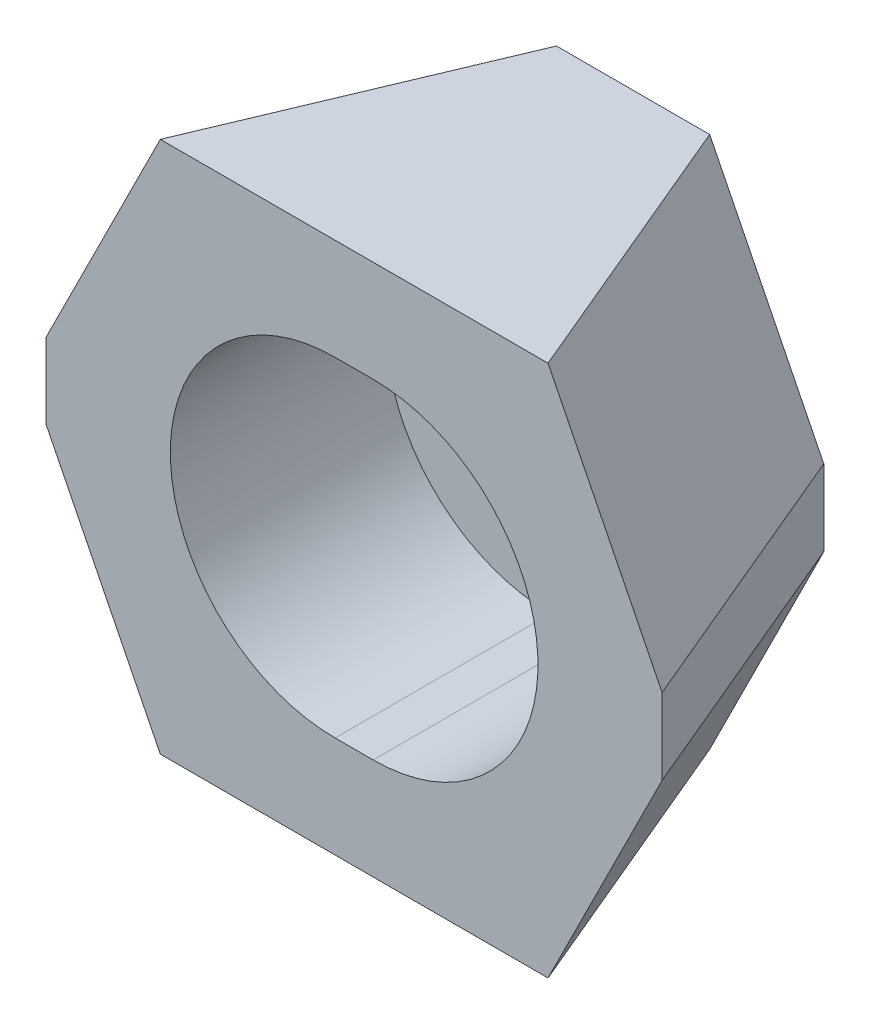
ISO-10303-21;
HEADER;
FILE_DESCRIPTION(('STEP AP214'),'2;1');
FILE_NAME('part.step','',(''),(''),'','','');
FILE_SCHEMA(('AUTOMOTIVE_DESIGN { 1 0 10303 214 1 1 1 1 }'));
ENDSEC;
DATA;
#1=APPLICATION_CONTEXT('core data for automotive mechanical design processes');
#2=APPLICATION_PROTOCOL_DEFINITION('international standard','automotive_design',2000,#1);
#3=PRODUCT_CONTEXT('',#1,'mechanical');
#4=PRODUCT('Part','Part','',(#3));
#5=PRODUCT_RELATED_PRODUCT_CATEGORY('part','',(#4));
#6=PRODUCT_DEFINITION_FORMATION('','',#4);
#7=PRODUCT_DEFINITION_CONTEXT('part definition',#1,'design');
#8=PRODUCT_DEFINITION('design','',#6,#7);
#9=PRODUCT_DEFINITION_SHAPE('','',#8);
#10=(LENGTH_UNIT() NAMED_UNIT(*) SI_UNIT(.MILLI.,.METRE.));
#11=(NAMED_UNIT(*) PLANE_ANGLE_UNIT() SI_UNIT($,.RADIAN.));
#12=(NAMED_UNIT(*) SI_UNIT($,.STERADIAN.) SOLID_ANGLE_UNIT());
#13=UNCERTAINTY_MEASURE_WITH_UNIT(LENGTH_MEASURE(1.E-05),#10,'distance_accuracy_value','');
#14=(GEOMETRIC_REPRESENTATION_CONTEXT(3) GLOBAL_UNCERTAINTY_ASSIGNED_CONTEXT((#13)) GLOBAL_UNIT_ASSIGNED_CONTEXT((#10,
#11,#12)) REPRESENTATION_CONTEXT('',''));
#15=CARTESIAN_POINT('',(0.,0.,0.));
#16=DIRECTION('',(0.,0.,1.));
#17=DIRECTION('',(1.,0.,0.));
#18=AXIS2_PLACEMENT_3D('',#15,#16,#17);
#19=CARTESIAN_POINT('',(-1.5,0.,5.));
#20=DIRECTION('',(0.,0.,1.));
#21=DIRECTION('',(1.,0.,0.));
#22=AXIS2_PLACEMENT_3D('',#19,#20,#21);
#23=CYLINDRICAL_SURFACE('',#22,13.);
#24=DIRECTION('',(0.,0.,1.));
#25=VECTOR('',#24,1.);
#26=CARTESIAN_POINT('',(-1.5,13.,5.));
#27=LINE('',#26,#25);
#28=CARTESIAN_POINT('',(-1.5,13.,5.));
#29=VERTEX_POINT('',#28);
#30=CARTESIAN_POINT('',(-1.5,13.,22.));
#31=VERTEX_POINT('',#30);
#32=EDGE_CURVE('E245',#29,#31,#27,.T.);
#33=ORIENTED_EDGE('',*,*,#32,.T.);
#34=CARTESIAN_POINT('',(-1.5,0.,22.));
#35=DIRECTION('',(0.,0.,1.));
#36=DIRECTION('',(1.,0.,0.));
#37=AXIS2_PLACEMENT_3D('',#34,#35,#36);
#38=CIRCLE('',#37,13.);
#39=CARTESIAN_POINT('',(-1.5,-13.,22.));
#40=VERTEX_POINT('',#39);
#41=EDGE_CURVE('E230',#31,#40,#38,.T.);
#42=ORIENTED_EDGE('',*,*,#41,.T.);
#43=DIRECTION('',(0.,0.,1.));
#44=VECTOR('',#43,1.);
#45=CARTESIAN_POINT('',(-1.5,-13.,5.));
#46=LINE('',#45,#44);
#47=CARTESIAN_POINT('',(-1.5,-13.,5.));
#48=VERTEX_POINT('',#47);
#49=EDGE_CURVE('E239',#48,#40,#46,.T.);
#50=ORIENTED_EDGE('',*,*,#49,.F.);
#51=CARTESIAN_POINT('',(-1.5,0.,5.));
#52=DIRECTION('',(0.,0.,1.));
#53=DIRECTION('',(1.,0.,0.));
#54=AXIS2_PLACEMENT_3D('',#51,#52,#53);
#55=CIRCLE('',#54,13.);
#56=EDGE_CURVE('E236',#29,#48,#55,.T.);
#57=ORIENTED_EDGE('',*,*,#56,.F.);
#58=EDGE_LOOP('',(#33,#42,#50,#57));
#59=FACE_BOUND('',#58,.T.);
#60=ADVANCED_FACE('F14',(#59),#23,.F.);
#61=CARTESIAN_POINT('',(-1.5,13.,5.));
#62=DIRECTION('',(0.,-1.,0.));
#63=DIRECTION('',(0.,0.,-1.));
#64=AXIS2_PLACEMENT_3D('',#61,#62,#63);
#65=PLANE('',#64);
#66=DIRECTION('',(1.,0.,0.));
#67=VECTOR('',#66,1.);
#68=CARTESIAN_POINT('',(-1.5,13.,5.));
#69=LINE('',#68,#67);
#70=CARTESIAN_POINT('',(1.5,13.,5.));
#71=VERTEX_POINT('',#70);
#72=EDGE_CURVE('E232',#29,#71,#69,.T.);
#73=ORIENTED_EDGE('',*,*,#72,.T.);
#74=DIRECTION('',(0.,0.,1.));
#75=VECTOR('',#74,1.);
#76=CARTESIAN_POINT('',(1.5,13.,5.));
#77=LINE('',#76,#75);
#78=CARTESIAN_POINT('',(1.5,13.,22.));
#79=VERTEX_POINT('',#78);
#80=EDGE_CURVE('E185',#71,#79,#77,.T.);
#81=ORIENTED_EDGE('',*,*,#80,.T.);
#82=DIRECTION('',(1.,0.,0.));
#83=VECTOR('',#82,1.);
#84=CARTESIAN_POINT('',(-1.5,13.,22.));
#85=LINE('',#84,#83);
#86=EDGE_CURVE('E229',#31,#79,#85,.T.);
#87=ORIENTED_EDGE('',*,*,#86,.F.);
#88=ORIENTED_EDGE('',*,*,#32,.F.);
#89=EDGE_LOOP('',(#73,#81,#87,#88));
#90=FACE_BOUND('',#89,.T.);
#91=ADVANCED_FACE('F418',(#90),#65,.T.);
#92=CARTESIAN_POINT('',(-1.5,-13.,5.));
#93=DIRECTION('',(0.,-1.,0.));
#94=DIRECTION('',(0.,0.,-1.));
#95=AXIS2_PLACEMENT_3D('',#92,#93,#94);
#96=PLANE('',#95);
#97=DIRECTION('',(1.,0.,0.));
#98=VECTOR('',#97,1.);
#99=CARTESIAN_POINT('',(-1.5,-13.,22.));
#100=LINE('',#99,#98);
#101=CARTESIAN_POINT('',(1.5,-13.,22.));
#102=VERTEX_POINT('',#101);
#103=EDGE_CURVE('E233',#40,#102,#100,.T.);
#104=ORIENTED_EDGE('',*,*,#103,.T.);
#105=DIRECTION('',(0.,0.,1.));
#106=VECTOR('',#105,1.);
#107=CARTESIAN_POINT('',(1.5,-13.,5.));
#108=LINE('',#107,#106);
#109=CARTESIAN_POINT('',(1.5,-13.,5.));
#110=VERTEX_POINT('',#109);
#111=EDGE_CURVE('E362',#110,#102,#108,.T.);
#112=ORIENTED_EDGE('',*,*,#111,.F.);
#113=DIRECTION('',(1.,0.,0.));
#114=VECTOR('',#113,1.);
#115=CARTESIAN_POINT('',(-1.5,-13.,5.));
#116=LINE('',#115,#114);
#117=EDGE_CURVE('E240',#48,#110,#116,.T.);
#118=ORIENTED_EDGE('',*,*,#117,.F.);
#119=ORIENTED_EDGE('',*,*,#49,.T.);
#120=EDGE_LOOP('',(#104,#112,#118,#119));
#121=FACE_BOUND('',#120,.T.);
#122=ADVANCED_FACE('F425',(#121),#96,.F.);
#123=CARTESIAN_POINT('',(-1.5,0.,5.));
#124=DIRECTION('',(0.,0.,1.));
#125=DIRECTION('',(1.,0.,0.));
#126=AXIS2_PLACEMENT_3D('',#123,#124,#125);
#127=PLANE('',#126);
#128=DIRECTION('',(-1.,0.,0.));
#129=VECTOR('',#128,1.);
#130=CARTESIAN_POINT('',(-1.5,8.5,5.));
#131=LINE('',#130,#129);
#132=CARTESIAN_POINT('',(1.5,8.5,5.));
#133=VERTEX_POINT('',#132);
#134=CARTESIAN_POINT('',(-1.5,8.5,5.));
#135=VERTEX_POINT('',#134);
#136=EDGE_CURVE('E222',#133,#135,#131,.T.);
#137=ORIENTED_EDGE('',*,*,#136,.F.);
#138=CARTESIAN_POINT('',(1.5,0.,5.));
#139=DIRECTION('',(0.,0.,-1.));
#140=DIRECTION('',(-1.,0.,0.));
#141=AXIS2_PLACEMENT_3D('',#138,#139,#140);
#142=CIRCLE('',#141,8.5);
#143=CARTESIAN_POINT('',(1.5,-8.5,5.));
#144=VERTEX_POINT('',#143);
#145=EDGE_CURVE('E371',#133,#144,#142,.T.);
#146=ORIENTED_EDGE('',*,*,#145,.T.);
#147=DIRECTION('',(-1.,0.,0.));
#148=VECTOR('',#147,1.);
#149=CARTESIAN_POINT('',(-1.5,-8.5,5.));
#150=LINE('',#149,#148);
#151=CARTESIAN_POINT('',(-1.5,-8.5,5.));
#152=VERTEX_POINT('',#151);
#153=EDGE_CURVE('E224',#144,#152,#150,.T.);
#154=ORIENTED_EDGE('',*,*,#153,.T.);
#155=CARTESIAN_POINT('',(-1.5,0.,5.));
#156=DIRECTION('',(0.,0.,1.));
#157=DIRECTION('',(1.,0.,0.));
#158=AXIS2_PLACEMENT_3D('',#155,#156,#157);
#159=CIRCLE('',#158,8.5);
#160=EDGE_CURVE('E226',#135,#152,#159,.T.);
#161=ORIENTED_EDGE('',*,*,#160,.F.);
#162=EDGE_LOOP('',(#137,#146,#154,#161));
#163=FACE_BOUND('',#162,.T.);
#164=CARTESIAN_POINT('',(1.5,0.,5.));
#165=DIRECTION('',(0.,0.,-1.));
#166=DIRECTION('',(-1.,0.,0.));
#167=AXIS2_PLACEMENT_3D('',#164,#165,#166);
#168=CIRCLE('',#167,13.);
#169=EDGE_CURVE('E365',#71,#110,#168,.T.);
#170=ORIENTED_EDGE('',*,*,#169,.F.);
#171=ORIENTED_EDGE('',*,*,#72,.F.);
#172=ORIENTED_EDGE('',*,*,#56,.T.);
#173=ORIENTED_EDGE('',*,*,#117,.T.);
#174=EDGE_LOOP('',(#170,#171,#172,#173));
#175=FACE_BOUND('',#174,.T.);
#176=ADVANCED_FACE('F428',(#163,#175),#127,.T.);
#177=CARTESIAN_POINT('',(-6.,21.,0.));
#178=DIRECTION('',(0.,1.,0.));
#179=DIRECTION('',(0.,0.,1.));
#180=AXIS2_PLACEMENT_3D('',#177,#178,#179);
#181=PLANE('',#180);
#182=DIRECTION('',(1.,0.,0.));
#183=VECTOR('',#182,1.);
#184=CARTESIAN_POINT('',(-15.,21.,22.));
#185=LINE('',#184,#183);
#186=CARTESIAN_POINT('',(-15.,21.,22.));
#187=VERTEX_POINT('',#186);
#188=CARTESIAN_POINT('',(15.,21.,22.));
#189=VERTEX_POINT('',#188);
#190=EDGE_CURVE('E297',#187,#189,#185,.T.);
#191=ORIENTED_EDGE('',*,*,#190,.T.);
#192=DIRECTION('',(1.,0.,0.));
#193=VECTOR('',#192,1.);
#194=CARTESIAN_POINT('',(15.,21.,22.));
#195=LINE('',#194,#193);
#196=CARTESIAN_POINT('',(15.2922839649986,21.,22.));
#197=VERTEX_POINT('',#196);
#198=EDGE_CURVE('E347',#189,#197,#195,.T.);
#199=ORIENTED_EDGE('',*,*,#198,.T.);
#200=DIRECTION('',(-0.387515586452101,0.,-0.921863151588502));
#201=VECTOR('',#200,1.);
#202=CARTESIAN_POINT('',(6.0376777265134,21.,-0.0158382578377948));
#203=LINE('',#202,#201);
#204=CARTESIAN_POINT('',(6.04433551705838,21.,0.));
#205=VERTEX_POINT('',#204);
#206=EDGE_CURVE('E381',#197,#205,#203,.T.);
#207=ORIENTED_EDGE('',*,*,#206,.T.);
#208=CARTESIAN_POINT('',(6.04433551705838,21.,0.));
#209=DIRECTION('',(-1.,0.,0.));
#210=VECTOR('',#209,1.);
#211=LINE('',#208,#210);
#212=CARTESIAN_POINT('',(6.,21.,0.));
#213=VERTEX_POINT('',#212);
#214=EDGE_CURVE('E258',#205,#213,#211,.T.);
#215=ORIENTED_EDGE('',*,*,#214,.T.);
#216=DIRECTION('',(1.,0.,0.));
#217=VECTOR('',#216,1.);
#218=CARTESIAN_POINT('',(-6.,21.,0.));
#219=LINE('',#218,#217);
#220=CARTESIAN_POINT('',(-6.,21.,0.));
#221=VERTEX_POINT('',#220);
#222=EDGE_CURVE('E299',#221,#213,#219,.T.);
#223=ORIENTED_EDGE('',*,*,#222,.F.);
#224=CARTESIAN_POINT('',(-6.04433551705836,21.,0.));
#225=DIRECTION('',(1.,0.,0.));
#226=VECTOR('',#225,1.);
#227=LINE('',#224,#226);
#228=CARTESIAN_POINT('',(-6.04433551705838,21.,0.));
#229=VERTEX_POINT('',#228);
#230=EDGE_CURVE('E211',#229,#221,#227,.T.);
#231=ORIENTED_EDGE('',*,*,#230,.F.);
#232=DIRECTION('',(0.387515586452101,0.,-0.921863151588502));
#233=VECTOR('',#232,1.);
#234=CARTESIAN_POINT('',(-6.0376777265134,21.,-0.0158382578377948));
#235=LINE('',#234,#233);
#236=CARTESIAN_POINT('',(-15.2922839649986,21.,22.));
#237=VERTEX_POINT('',#236);
#238=EDGE_CURVE('E205',#237,#229,#235,.T.);
#239=ORIENTED_EDGE('',*,*,#238,.F.);
#240=DIRECTION('',(-1.,0.,0.));
#241=VECTOR('',#240,1.);
#242=CARTESIAN_POINT('',(-15.,21.,22.));
#243=LINE('',#242,#241);
#244=EDGE_CURVE('E327',#187,#237,#243,.T.);
#245=ORIENTED_EDGE('',*,*,#244,.F.);
#246=EDGE_LOOP('',(#191,#199,#207,#215,#223,#231,#239,#245));
#247=FACE_BOUND('',#246,.T.);
#248=ADVANCED_FACE('F272',(#247),#181,.T.);
#249=CARTESIAN_POINT('',(-24.2922839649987,3.,22.));
#250=DIRECTION('',(0.,0.,1.));
#251=DIRECTION('',(1.,0.,0.));
#252=AXIS2_PLACEMENT_3D('',#249,#250,#251);
#253=PLANE('',#252);
#254=ORIENTED_EDGE('',*,*,#86,.T.);
#255=CARTESIAN_POINT('',(1.5,0.,22.));
#256=DIRECTION('',(0.,0.,-1.));
#257=DIRECTION('',(-1.,0.,0.));
#258=AXIS2_PLACEMENT_3D('',#255,#256,#257);
#259=CIRCLE('',#258,13.);
#260=EDGE_CURVE('E368',#79,#102,#259,.T.);
#261=ORIENTED_EDGE('',*,*,#260,.T.);
#262=ORIENTED_EDGE('',*,*,#103,.F.);
#263=ORIENTED_EDGE('',*,*,#41,.F.);
#264=EDGE_LOOP('',(#254,#261,#262,#263));
#265=FACE_BOUND('',#264,.T.);
#266=ORIENTED_EDGE('',*,*,#198,.F.);
#267=ORIENTED_EDGE('',*,*,#190,.F.);
#268=ORIENTED_EDGE('',*,*,#244,.T.);
#269=DIRECTION('',(0.447213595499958,0.894427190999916,0.));
#270=VECTOR('',#269,1.);
#271=CARTESIAN_POINT('',(-24.2922839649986,2.99999999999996,22.));
#272=LINE('',#271,#270);
#273=CARTESIAN_POINT('',(-24.2922839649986,3.,22.));
#274=VERTEX_POINT('',#273);
#275=EDGE_CURVE('E207',#274,#237,#272,.T.);
#276=ORIENTED_EDGE('',*,*,#275,.F.);
#277=DIRECTION('',(0.,-1.,0.));
#278=VECTOR('',#277,1.);
#279=CARTESIAN_POINT('',(-24.2922839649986,3.,22.));
#280=LINE('',#279,#278);
#281=CARTESIAN_POINT('',(-24.2922839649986,-3.,22.));
#282=VERTEX_POINT('',#281);
#283=EDGE_CURVE('E202',#274,#282,#280,.T.);
#284=ORIENTED_EDGE('',*,*,#283,.T.);
#285=DIRECTION('',(-0.447213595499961,0.894427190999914,0.));
#286=VECTOR('',#285,1.);
#287=CARTESIAN_POINT('',(-26.6922839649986,1.80000000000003,22.));
#288=LINE('',#287,#286);
#289=CARTESIAN_POINT('',(-15.2922839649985,-21.,22.));
#290=VERTEX_POINT('',#289);
#291=EDGE_CURVE('E198',#290,#282,#288,.T.);
#292=ORIENTED_EDGE('',*,*,#291,.F.);
#293=DIRECTION('',(1.,0.,0.));
#294=VECTOR('',#293,1.);
#295=CARTESIAN_POINT('',(-15.,-21.,22.));
#296=LINE('',#295,#294);
#297=CARTESIAN_POINT('',(-15.,-21.,22.));
#298=VERTEX_POINT('',#297);
#299=EDGE_CURVE('E218',#290,#298,#296,.T.);
#300=ORIENTED_EDGE('',*,*,#299,.T.);
#301=DIRECTION('',(-1.,0.,0.));
#302=VECTOR('',#301,1.);
#303=CARTESIAN_POINT('',(15.,-21.,22.));
#304=LINE('',#303,#302);
#305=CARTESIAN_POINT('',(15.,-21.,22.));
#306=VERTEX_POINT('',#305);
#307=EDGE_CURVE('E247',#306,#298,#304,.T.);
#308=ORIENTED_EDGE('',*,*,#307,.F.);
#309=DIRECTION('',(-1.,0.,0.));
#310=VECTOR('',#309,1.);
#311=CARTESIAN_POINT('',(15.,-21.,22.));
#312=LINE('',#311,#310);
#313=CARTESIAN_POINT('',(15.2922839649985,-21.,22.));
#314=VERTEX_POINT('',#313);
#315=EDGE_CURVE('E345',#314,#306,#312,.T.);
#316=ORIENTED_EDGE('',*,*,#315,.F.);
#317=DIRECTION('',(0.447213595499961,0.894427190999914,0.));
#318=VECTOR('',#317,1.);
#319=CARTESIAN_POINT('',(26.6922839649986,1.80000000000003,22.));
#320=LINE('',#319,#318);
#321=CARTESIAN_POINT('',(24.2922839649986,-3.,22.));
#322=VERTEX_POINT('',#321);
#323=EDGE_CURVE('E176',#314,#322,#320,.T.);
#324=ORIENTED_EDGE('',*,*,#323,.T.);
#325=DIRECTION('',(0.,-1.,0.));
#326=VECTOR('',#325,1.);
#327=CARTESIAN_POINT('',(24.2922839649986,3.,22.));
#328=LINE('',#327,#326);
#329=CARTESIAN_POINT('',(24.2922839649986,3.,22.));
#330=VERTEX_POINT('',#329);
#331=EDGE_CURVE('E163',#330,#322,#328,.T.);
#332=ORIENTED_EDGE('',*,*,#331,.F.);
#333=DIRECTION('',(-0.447213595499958,0.894427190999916,0.));
#334=VECTOR('',#333,1.);
#335=CARTESIAN_POINT('',(24.2922839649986,2.99999999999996,22.));
#336=LINE('',#335,#334);
#337=EDGE_CURVE('E379',#330,#197,#336,.T.);
#338=ORIENTED_EDGE('',*,*,#337,.T.);
#339=EDGE_LOOP('',(#266,#267,#268,#276,#284,#292,#300,#308,#316,#324,#332,#338));
#340=FACE_BOUND('',#339,.T.);
#341=ADVANCED_FACE('F16',(#265,#340),#253,.T.);
#342=CARTESIAN_POINT('',(15.0443355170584,3.,0.));
#343=DIRECTION('',(0.,0.,-1.));
#344=DIRECTION('',(0.,1.,0.));
#345=AXIS2_PLACEMENT_3D('',#342,#343,#344);
#346=PLANE('',#345);
#347=ORIENTED_EDGE('',*,*,#222,.T.);
#348=ORIENTED_EDGE('',*,*,#214,.F.);
#349=DIRECTION('',(0.447213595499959,-0.894427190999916,0.));
#350=VECTOR('',#349,1.);
#351=CARTESIAN_POINT('',(9.02660131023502,15.0354684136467,0.));
#352=LINE('',#351,#350);
#353=CARTESIAN_POINT('',(15.0443355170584,3.,0.));
#354=VERTEX_POINT('',#353);
#355=EDGE_CURVE('E181',#205,#354,#352,.T.);
#356=ORIENTED_EDGE('',*,*,#355,.T.);
#357=DIRECTION('',(0.,1.,0.));
#358=VECTOR('',#357,1.);
#359=CARTESIAN_POINT('',(15.0443355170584,3.,0.));
#360=LINE('',#359,#358);
#361=CARTESIAN_POINT('',(15.0443355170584,-3.,0.));
#362=VERTEX_POINT('',#361);
#363=EDGE_CURVE('E160',#362,#354,#360,.T.);
#364=ORIENTED_EDGE('',*,*,#363,.F.);
#365=DIRECTION('',(-0.447213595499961,-0.894427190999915,0.));
#366=VECTOR('',#365,1.);
#367=CARTESIAN_POINT('',(11.426601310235,-10.2354684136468,0.));
#368=LINE('',#367,#366);
#369=CARTESIAN_POINT('',(6.04433551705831,-21.,0.));
#370=VERTEX_POINT('',#369);
#371=EDGE_CURVE('E170',#362,#370,#368,.T.);
#372=ORIENTED_EDGE('',*,*,#371,.T.);
#373=CARTESIAN_POINT('',(6.,-21.,0.));
#374=DIRECTION('',(1.,0.,0.));
#375=VECTOR('',#374,1.);
#376=LINE('',#373,#375);
#377=CARTESIAN_POINT('',(6.,-21.,0.));
#378=VERTEX_POINT('',#377);
#379=EDGE_CURVE('E353',#378,#370,#376,.T.);
#380=ORIENTED_EDGE('',*,*,#379,.F.);
#381=DIRECTION('',(1.,0.,0.));
#382=VECTOR('',#381,1.);
#383=CARTESIAN_POINT('',(-6.,-21.,0.));
#384=LINE('',#383,#382);
#385=CARTESIAN_POINT('',(-6.,-21.,0.));
#386=VERTEX_POINT('',#385);
#387=EDGE_CURVE('E250',#386,#378,#384,.T.);
#388=ORIENTED_EDGE('',*,*,#387,.F.);
#389=CARTESIAN_POINT('',(-6.,-21.,1.23554857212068E-13));
#390=DIRECTION('',(-1.,0.,0.));
#391=VECTOR('',#390,1.);
#392=LINE('',#389,#391);
#393=CARTESIAN_POINT('',(-6.04433551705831,-21.,0.));
#394=VERTEX_POINT('',#393);
#395=EDGE_CURVE('E294',#386,#394,#392,.T.);
#396=ORIENTED_EDGE('',*,*,#395,.T.);
#397=DIRECTION('',(0.447213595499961,-0.894427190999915,0.));
#398=VECTOR('',#397,1.);
#399=CARTESIAN_POINT('',(-11.426601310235,-10.2354684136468,0.));
#400=LINE('',#399,#398);
#401=CARTESIAN_POINT('',(-15.0443355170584,-3.,0.));
#402=VERTEX_POINT('',#401);
#403=EDGE_CURVE('E33',#402,#394,#400,.T.);
#404=ORIENTED_EDGE('',*,*,#403,.F.);
#405=DIRECTION('',(0.,1.,0.));
#406=VECTOR('',#405,1.);
#407=CARTESIAN_POINT('',(-15.0443355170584,3.,0.));
#408=LINE('',#407,#406);
#409=CARTESIAN_POINT('',(-15.0443355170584,3.,0.));
#410=VERTEX_POINT('',#409);
#411=EDGE_CURVE('E25',#402,#410,#408,.T.);
#412=ORIENTED_EDGE('',*,*,#411,.T.);
#413=DIRECTION('',(-0.447213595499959,-0.894427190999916,0.));
#414=VECTOR('',#413,1.);
#415=CARTESIAN_POINT('',(-9.02660131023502,15.0354684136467,0.));
#416=LINE('',#415,#414);
#417=EDGE_CURVE('E9',#229,#410,#416,.T.);
#418=ORIENTED_EDGE('',*,*,#417,.F.);
#419=ORIENTED_EDGE('',*,*,#230,.T.);
#420=EDGE_LOOP('',(#347,#348,#356,#364,#372,#380,#388,#396,#404,#412,#418,#419));
#421=FACE_BOUND('',#420,.T.);
#422=DIRECTION('',(1.,0.,0.));
#423=VECTOR('',#422,1.);
#424=CARTESIAN_POINT('',(-1.5,-8.5,0.));
#425=LINE('',#424,#423);
#426=CARTESIAN_POINT('',(-1.5,-8.5,0.));
#427=VERTEX_POINT('',#426);
#428=CARTESIAN_POINT('',(1.5,-8.5,0.));
#429=VERTEX_POINT('',#428);
#430=EDGE_CURVE('E216',#427,#429,#425,.T.);
#431=ORIENTED_EDGE('',*,*,#430,.T.);
#432=CARTESIAN_POINT('',(1.5,0.,0.));
#433=DIRECTION('',(0.,0.,1.));
#434=DIRECTION('',(0.,1.,0.));
#435=AXIS2_PLACEMENT_3D('',#432,#433,#434);
#436=CIRCLE('',#435,8.5);
#437=CARTESIAN_POINT('',(1.5,8.5,0.));
#438=VERTEX_POINT('',#437);
#439=EDGE_CURVE('E346',#429,#438,#436,.T.);
#440=ORIENTED_EDGE('',*,*,#439,.T.);
#441=DIRECTION('',(1.,0.,0.));
#442=VECTOR('',#441,1.);
#443=CARTESIAN_POINT('',(-1.5,8.5,0.));
#444=LINE('',#443,#442);
#445=CARTESIAN_POINT('',(-1.5,8.5,0.));
#446=VERTEX_POINT('',#445);
#447=EDGE_CURVE('E214',#446,#438,#444,.T.);
#448=ORIENTED_EDGE('',*,*,#447,.F.);
#449=CARTESIAN_POINT('',(-1.5,0.,0.));
#450=DIRECTION('',(0.,0.,-1.));
#451=DIRECTION('',(0.,1.,0.));
#452=AXIS2_PLACEMENT_3D('',#449,#450,#451);
#453=CIRCLE('',#452,8.5);
#454=EDGE_CURVE('E41',#427,#446,#453,.T.);
#455=ORIENTED_EDGE('',*,*,#454,.F.);
#456=EDGE_LOOP('',(#431,#440,#448,#455));
#457=FACE_BOUND('',#456,.T.);
#458=ADVANCED_FACE('F178',(#421,#457),#346,.T.);
#459=CARTESIAN_POINT('',(15.,-21.,22.));
#460=DIRECTION('',(0.,1.,0.));
#461=DIRECTION('',(0.,0.,1.));
#462=AXIS2_PLACEMENT_3D('',#459,#460,#461);
#463=PLANE('',#462);
#464=ORIENTED_EDGE('',*,*,#387,.T.);
#465=ORIENTED_EDGE('',*,*,#379,.T.);
#466=DIRECTION('',(-0.387515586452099,0.,-0.921863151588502));
#467=VECTOR('',#466,1.);
#468=CARTESIAN_POINT('',(10.7433422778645,-21.,11.178495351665));
#469=LINE('',#468,#467);
#470=EDGE_CURVE('E172',#314,#370,#469,.T.);
#471=ORIENTED_EDGE('',*,*,#470,.F.);
#472=ORIENTED_EDGE('',*,*,#315,.T.);
#473=ORIENTED_EDGE('',*,*,#307,.T.);
#474=ORIENTED_EDGE('',*,*,#299,.F.);
#475=DIRECTION('',(0.387515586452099,0.,-0.921863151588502));
#476=VECTOR('',#475,1.);
#477=CARTESIAN_POINT('',(-10.7433422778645,-21.,11.178495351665));
#478=LINE('',#477,#476);
#479=EDGE_CURVE('E302',#290,#394,#478,.T.);
#480=ORIENTED_EDGE('',*,*,#479,.T.);
#481=ORIENTED_EDGE('',*,*,#395,.F.);
#482=EDGE_LOOP('',(#464,#465,#471,#472,#473,#474,#480,#481));
#483=FACE_BOUND('',#482,.T.);
#484=ADVANCED_FACE('F271',(#483),#463,.F.);
#485=CARTESIAN_POINT('',(-1.5,0.,22.));
#486=DIRECTION('',(0.,0.,-1.));
#487=DIRECTION('',(0.,1.,0.));
#488=AXIS2_PLACEMENT_3D('',#485,#486,#487);
#489=CYLINDRICAL_SURFACE('',#488,8.5);
#490=ORIENTED_EDGE('',*,*,#160,.T.);
#491=DIRECTION('',(0.,0.,-1.));
#492=VECTOR('',#491,1.);
#493=CARTESIAN_POINT('',(-1.5,-8.5,22.));
#494=LINE('',#493,#492);
#495=EDGE_CURVE('E220',#152,#427,#494,.T.);
#496=ORIENTED_EDGE('',*,*,#495,.T.);
#497=ORIENTED_EDGE('',*,*,#454,.T.);
#498=DIRECTION('',(0.,0.,-1.));
#499=VECTOR('',#498,1.);
#500=CARTESIAN_POINT('',(-1.5,8.5,22.));
#501=LINE('',#500,#499);
#502=EDGE_CURVE('E213',#135,#446,#501,.T.);
#503=ORIENTED_EDGE('',*,*,#502,.F.);
#504=EDGE_LOOP('',(#490,#496,#497,#503));
#505=FACE_BOUND('',#504,.T.);
#506=ADVANCED_FACE('F436',(#505),#489,.F.);
#507=CARTESIAN_POINT('',(-1.5,-8.5,22.));
#508=DIRECTION('',(0.,1.,0.));
#509=DIRECTION('',(0.,0.,1.));
#510=AXIS2_PLACEMENT_3D('',#507,#508,#509);
#511=PLANE('',#510);
#512=ORIENTED_EDGE('',*,*,#153,.F.);
#513=DIRECTION('',(0.,0.,-1.));
#514=VECTOR('',#513,1.);
#515=CARTESIAN_POINT('',(1.5,-8.5,22.));
#516=LINE('',#515,#514);
#517=EDGE_CURVE('E374',#144,#429,#516,.T.);
#518=ORIENTED_EDGE('',*,*,#517,.T.);
#519=ORIENTED_EDGE('',*,*,#430,.F.);
#520=ORIENTED_EDGE('',*,*,#495,.F.);
#521=EDGE_LOOP('',(#512,#518,#519,#520));
#522=FACE_BOUND('',#521,.T.);
#523=ADVANCED_FACE('F414',(#522),#511,.T.);
#524=CARTESIAN_POINT('',(-1.5,8.5,22.));
#525=DIRECTION('',(0.,1.,0.));
#526=DIRECTION('',(0.,0.,1.));
#527=AXIS2_PLACEMENT_3D('',#524,#525,#526);
#528=PLANE('',#527);
#529=ORIENTED_EDGE('',*,*,#447,.T.);
#530=DIRECTION('',(0.,0.,-1.));
#531=VECTOR('',#530,1.);
#532=CARTESIAN_POINT('',(1.5,8.5,22.));
#533=LINE('',#532,#531);
#534=EDGE_CURVE('E350',#133,#438,#533,.T.);
#535=ORIENTED_EDGE('',*,*,#534,.F.);
#536=ORIENTED_EDGE('',*,*,#136,.T.);
#537=ORIENTED_EDGE('',*,*,#502,.T.);
#538=EDGE_LOOP('',(#529,#535,#536,#537));
#539=FACE_BOUND('',#538,.T.);
#540=ADVANCED_FACE('F402',(#539),#528,.F.);
#541=CARTESIAN_POINT('',(-22.1904774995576,3.,17.));
#542=DIRECTION('',(0.83720751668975,-0.418603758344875,0.351929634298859));
#543=DIRECTION('',(0.447213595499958,0.894427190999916,0.));
#544=AXIS2_PLACEMENT_3D('',#541,#542,#543);
#545=PLANE('',#544);
#546=DIRECTION('',(0.387515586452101,0.,-0.921863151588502));
#547=VECTOR('',#546,1.);
#548=CARTESIAN_POINT('',(-22.1904774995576,3.,17.));
#549=LINE('',#548,#547);
#550=EDGE_CURVE('E194',#274,#410,#549,.T.);
#551=ORIENTED_EDGE('',*,*,#550,.F.);
#552=ORIENTED_EDGE('',*,*,#275,.T.);
#553=ORIENTED_EDGE('',*,*,#238,.T.);
#554=ORIENTED_EDGE('',*,*,#417,.T.);
#555=EDGE_LOOP('',(#551,#552,#553,#554));
#556=FACE_BOUND('',#555,.T.);
#557=ADVANCED_FACE('F395',(#556),#545,.F.);
#558=CARTESIAN_POINT('',(-10.,-3.,-12.));
#559=DIRECTION('',(-0.921863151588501,0.,-0.387515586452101));
#560=DIRECTION('',(-0.387515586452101,0.,0.921863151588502));
#561=AXIS2_PLACEMENT_3D('',#558,#559,#560);
#562=PLANE('',#561);
#563=ORIENTED_EDGE('',*,*,#283,.F.);
#564=ORIENTED_EDGE('',*,*,#550,.T.);
#565=ORIENTED_EDGE('',*,*,#411,.F.);
#566=DIRECTION('',(-0.387515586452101,0.,0.921863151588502));
#567=VECTOR('',#566,1.);
#568=CARTESIAN_POINT('',(-10.,-3.,-12.));
#569=LINE('',#568,#567);
#570=EDGE_CURVE('E183',#402,#282,#569,.T.);
#571=ORIENTED_EDGE('',*,*,#570,.T.);
#572=EDGE_LOOP('',(#563,#564,#565,#571));
#573=FACE_BOUND('',#572,.T.);
#574=ADVANCED_FACE('F397',(#573),#562,.T.);
#575=CARTESIAN_POINT('',(-13.1904774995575,-21.,17.));
#576=DIRECTION('',(0.837207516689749,0.418603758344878,0.351929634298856));
#577=DIRECTION('',(-0.447213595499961,0.894427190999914,0.));
#578=AXIS2_PLACEMENT_3D('',#575,#576,#577);
#579=PLANE('',#578);
#580=ORIENTED_EDGE('',*,*,#479,.F.);
#581=ORIENTED_EDGE('',*,*,#291,.T.);
#582=ORIENTED_EDGE('',*,*,#570,.F.);
#583=ORIENTED_EDGE('',*,*,#403,.T.);
#584=EDGE_LOOP('',(#580,#581,#582,#583));
#585=FACE_BOUND('',#584,.T.);
#586=ADVANCED_FACE('F398',(#585),#579,.F.);
#587=CARTESIAN_POINT('',(1.5,0.,5.));
#588=DIRECTION('',(0.,0.,1.));
#589=DIRECTION('',(-1.,0.,0.));
#590=AXIS2_PLACEMENT_3D('',#587,#588,#589);
#591=CYLINDRICAL_SURFACE('',#590,13.);
#592=ORIENTED_EDGE('',*,*,#80,.F.);
#593=ORIENTED_EDGE('',*,*,#169,.T.);
#594=ORIENTED_EDGE('',*,*,#111,.T.);
#595=ORIENTED_EDGE('',*,*,#260,.F.);
#596=EDGE_LOOP('',(#592,#593,#594,#595));
#597=FACE_BOUND('',#596,.T.);
#598=ADVANCED_FACE('F400',(#597),#591,.F.);
#599=CARTESIAN_POINT('',(1.5,0.,22.));
#600=DIRECTION('',(0.,0.,-1.));
#601=DIRECTION('',(0.,1.,0.));
#602=AXIS2_PLACEMENT_3D('',#599,#600,#601);
#603=CYLINDRICAL_SURFACE('',#602,8.5);
#604=ORIENTED_EDGE('',*,*,#145,.F.);
#605=ORIENTED_EDGE('',*,*,#534,.T.);
#606=ORIENTED_EDGE('',*,*,#439,.F.);
#607=ORIENTED_EDGE('',*,*,#517,.F.);
#608=EDGE_LOOP('',(#604,#605,#606,#607));
#609=FACE_BOUND('',#608,.T.);
#610=ADVANCED_FACE('F409',(#609),#603,.F.);
#611=CARTESIAN_POINT('',(22.1904774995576,3.,17.));
#612=DIRECTION('',(-0.83720751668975,-0.418603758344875,0.351929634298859));
#613=DIRECTION('',(-0.447213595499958,0.894427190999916,0.));
#614=AXIS2_PLACEMENT_3D('',#611,#612,#613);
#615=PLANE('',#614);
#616=DIRECTION('',(-0.387515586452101,0.,-0.921863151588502));
#617=VECTOR('',#616,1.);
#618=CARTESIAN_POINT('',(22.1904774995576,3.,17.));
#619=LINE('',#618,#617);
#620=EDGE_CURVE('E167',#330,#354,#619,.T.);
#621=ORIENTED_EDGE('',*,*,#620,.T.);
#622=ORIENTED_EDGE('',*,*,#355,.F.);
#623=ORIENTED_EDGE('',*,*,#206,.F.);
#624=ORIENTED_EDGE('',*,*,#337,.F.);
#625=EDGE_LOOP('',(#621,#622,#623,#624));
#626=FACE_BOUND('',#625,.T.);
#627=ADVANCED_FACE('F391',(#626),#615,.F.);
#628=CARTESIAN_POINT('',(10.,-3.,-12.));
#629=DIRECTION('',(0.921863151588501,0.,-0.387515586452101));
#630=DIRECTION('',(0.387515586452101,0.,0.921863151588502));
#631=AXIS2_PLACEMENT_3D('',#628,#629,#630);
#632=PLANE('',#631);
#633=ORIENTED_EDGE('',*,*,#331,.T.);
#634=DIRECTION('',(0.387515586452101,0.,0.921863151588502));
#635=VECTOR('',#634,1.);
#636=CARTESIAN_POINT('',(10.,-3.,-12.));
#637=LINE('',#636,#635);
#638=EDGE_CURVE('E156',#362,#322,#637,.T.);
#639=ORIENTED_EDGE('',*,*,#638,.F.);
#640=ORIENTED_EDGE('',*,*,#363,.T.);
#641=ORIENTED_EDGE('',*,*,#620,.F.);
#642=EDGE_LOOP('',(#633,#639,#640,#641));
#643=FACE_BOUND('',#642,.T.);
#644=ADVANCED_FACE('F158',(#643),#632,.T.);
#645=CARTESIAN_POINT('',(13.1904774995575,-21.,17.));
#646=DIRECTION('',(-0.837207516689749,0.418603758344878,0.351929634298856));
#647=DIRECTION('',(0.447213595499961,0.894427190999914,0.));
#648=AXIS2_PLACEMENT_3D('',#645,#646,#647);
#649=PLANE('',#648);
#650=ORIENTED_EDGE('',*,*,#470,.T.);
#651=ORIENTED_EDGE('',*,*,#371,.F.);
#652=ORIENTED_EDGE('',*,*,#638,.T.);
#653=ORIENTED_EDGE('',*,*,#323,.F.);
#654=EDGE_LOOP('',(#650,#651,#652,#653));
#655=FACE_BOUND('',#654,.T.);
#656=ADVANCED_FACE('F171',(#655),#649,.F.);
#657=CLOSED_SHELL('',(#60,#91,#122,#176,#248,#341,#458,#484,#506,#523,#540,#557,#574,#586,#598,
#610,#627,#644,#656));
#658=MANIFOLD_SOLID_BREP('B1',#657);
#659=ADVANCED_BREP_SHAPE_REPRESENTATION('',(#18,#658),#14);
#660=SHAPE_DEFINITION_REPRESENTATION(#9,#659);
ENDSEC;
END-ISO-10303-21;
